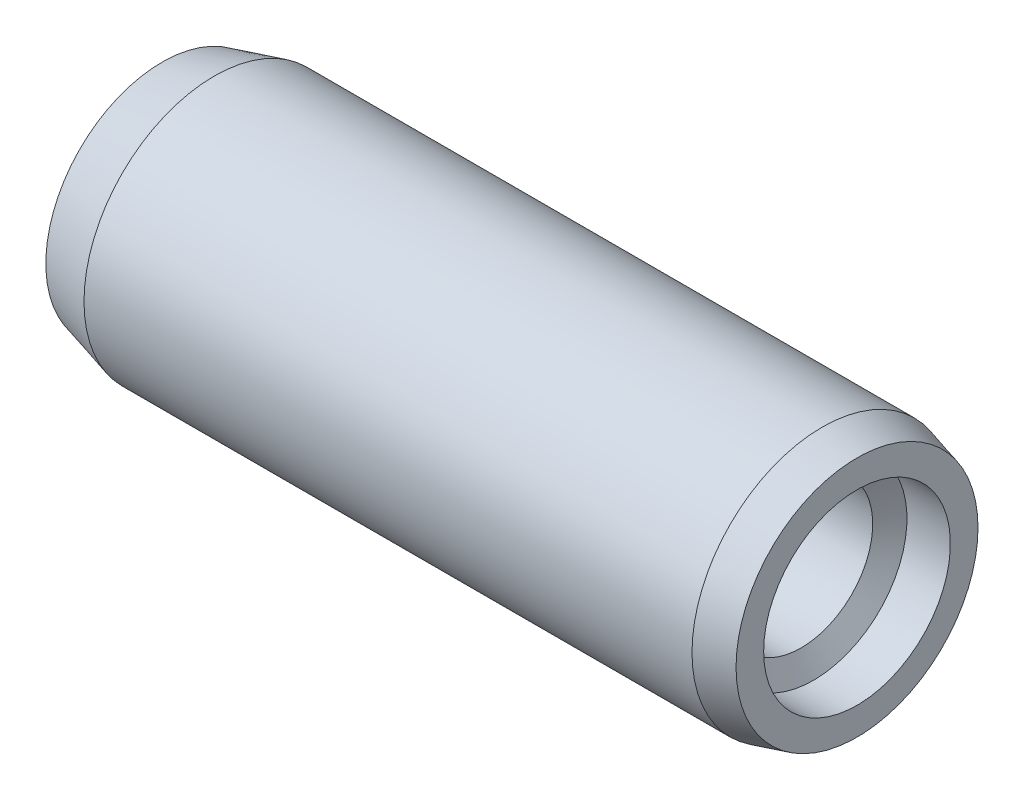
from build123d import *


with BuildPart() as part:
    # Sketch1 → Base-Revolve (revolve)
    with BuildSketch(Plane.XY, mode=Mode.PRIVATE) as base_revolve_sk:
        Polygon((0, 0), (0, 2.678460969), (1.2, 3), (15.2, 3), (16, 2.785640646), (16, 0), align=None)
    revolve(base_revolve_sk.sketch.rotate(Axis((0, 0, 0), (-1, 0, 0)), 90), axis=Axis((0, 0, 0), (-1, 0, 0)))

    # Sketch2 → TypeA (revolve, cut)
    with BuildSketch(Plane.XY, mode=Mode.PRIVATE) as typea_sk:
        Polygon((16, 2.15), (15, 2.15), (14.711324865, 1.65), (6, 1.65), (5.047372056, 0), (16, 0), align=None)
    revolve(typea_sk.sketch.rotate(Axis((16, 0, 0), (1, 0, 0)), 90), axis=Axis((16, 0, 0), (1, 0, 0)), mode=Mode.SUBTRACT)


solid = part.part
